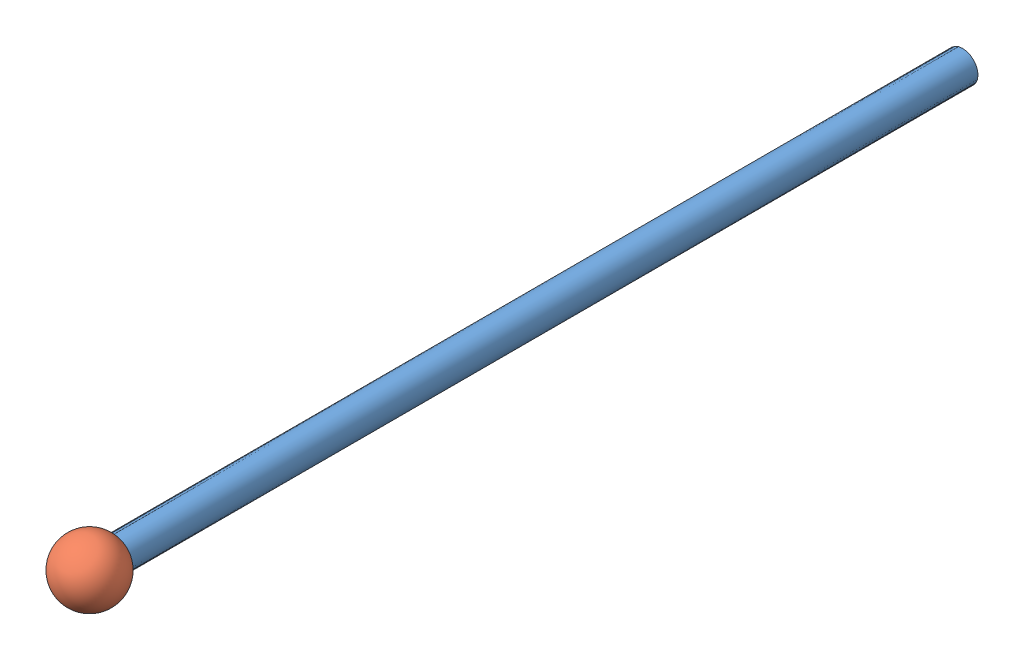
SolidWorks assembly LongMarker_StickAndBall.SLDASM, configuration Default (file format 13000). Lengths in mm.
Overall size (6 6 88).
2 component instances, 2 part files, 1 mates.
Components (placement in the parent):
- LongmarkerStick-1: LongmarkerStick.SLDPRT [Default] at (14.7774 44.0534 29.7665) size (3 3 82.4)
- MarkerBall-1: MarkerBall.SLDPRT [Default] at (14.7774 44.0534 114.7646) size (6 6 6)
Mates (geometry in assembly coordinates):
- Coincident1: coincident: circle of LongmarkerStick-1; sphere of MarkerBall-1
